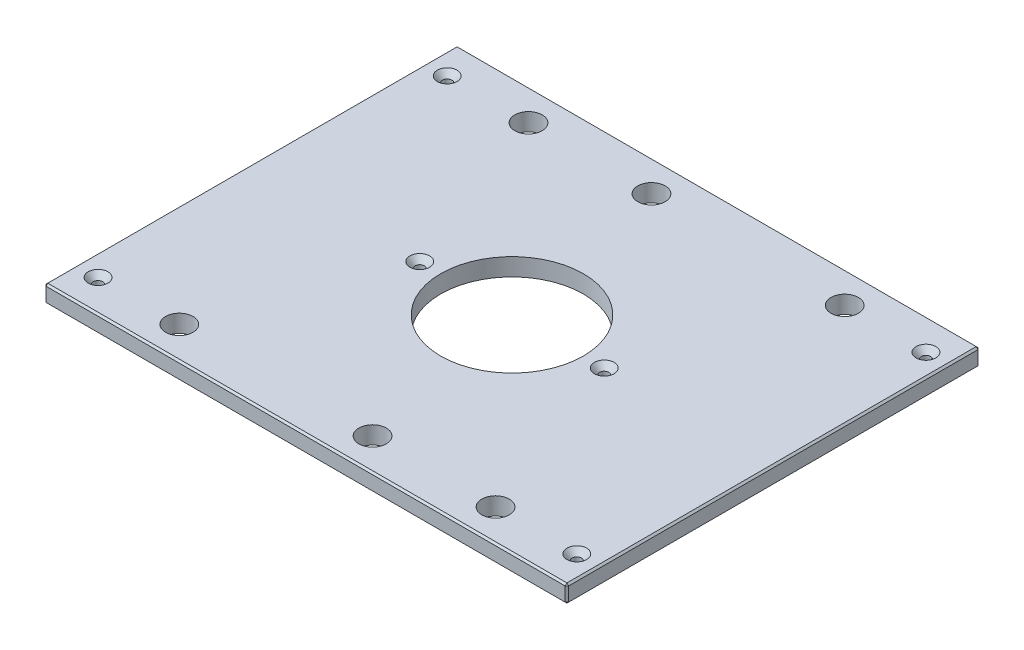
from build123d import *

# Parameters (mm, degrees)
SKETCH1_W                                        = 377.825
SKETCH1_H                                        = 298.45
BOSS_EXTRUDE1_DEPTH                              = 12.7
SKETCH13_R                                       = 51.562
CUT_EXTRUDE6_DEPTH                               = 242.075347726
F_25_32_0_78125_DIAMETER_HOLE1_D                 = 19.84375
CHAMFER2_SIZE                                    = 1.27
CSK_FOR_1_4_FLAT_HEAD_MACHINE_SCREW1_D           = 6.7564
CSK_FOR_1_4_FLAT_HEAD_MACHINE_SCREW1_CSINK_D     = 14.2748
CSK_FOR_1_4_FLAT_HEAD_MACHINE_SCREW1_CSINK_ANGLE = 82


with BuildPart() as part:
    # Sketch1 → Boss-Extrude1 (new body)
    with BuildSketch(Plane(origin=(0, 0, 0), x_dir=(1, 0, 0), z_dir=(0, 1, 0))):
        Rectangle(SKETCH1_W, SKETCH1_H)
    extrude(amount=BOSS_EXTRUDE1_DEPTH)

    # Sketch13 → Cut-Extrude6 (cut, through all)
    with BuildSketch(Plane(origin=(0, 12.7, 0), x_dir=(1, 0, 0), z_dir=(0, 1, 0))):
        with Locations(Location((0, 0, 0), (0, 0, 270))):
            Circle(SKETCH13_R)
    extrude(amount=-CUT_EXTRUDE6_DEPTH, mode=Mode.SUBTRACT)

    # 25_32 _0.78125_ Diameter Hole1 (through all)
    with Locations(Plane(origin=(0, 12.7, 0), x_dir=(1, 0, 0), z_dir=(0, 1, 0))):
        with Locations((114.3, 126.20498), (-114.3, 126.20498), (114.3, -126.20498), (-114.3, -126.20498), (-25.4, 126.20498), (25.4, -126.20498)):
            Hole(F_25_32_0_78125_DIAMETER_HOLE1_D / 2)

    # Chamfer2
    chamfer2_edges = [part.edges().sort_by_distance(p)[0] for p in [
        (188.9125, 12.7, 0),
        (0, 12.7, -149.225),
        (-188.9125, 12.7, 0),
        (0, 0, -149.225),
        (188.9125, 0, 0),
        (0, 0, 149.225),
        (-188.9125, 0, 0),
        (0, 12.7, 149.225),
        (-188.9125, 6.35, -149.225),
        (188.9125, 6.35, -149.225),
        (188.9125, 6.35, 149.225),
        (-188.9125, 6.35, 149.225),
    ]]
    chamfer(chamfer2_edges, length=CHAMFER2_SIZE)

    # CSK for 1_4 Flat Head Machine Screw1 (through all)
    with Locations(Plane(origin=(0, 12.7, 0), x_dir=(1, 0, 0), z_dir=(0, 1, 0))):
        with Locations((173.0375, 126.20498), (173.0375, -126.20498), (-173.0375, -126.20498), (-66.675, 0), (66.675, 0), (-173.0375, 126.20498), (-114.3, 126.20498), (-114.3, -126.20498)):
            CounterSinkHole(CSK_FOR_1_4_FLAT_HEAD_MACHINE_SCREW1_D / 2, CSK_FOR_1_4_FLAT_HEAD_MACHINE_SCREW1_CSINK_D / 2, counter_sink_angle=CSK_FOR_1_4_FLAT_HEAD_MACHINE_SCREW1_CSINK_ANGLE)


solid = part.part
